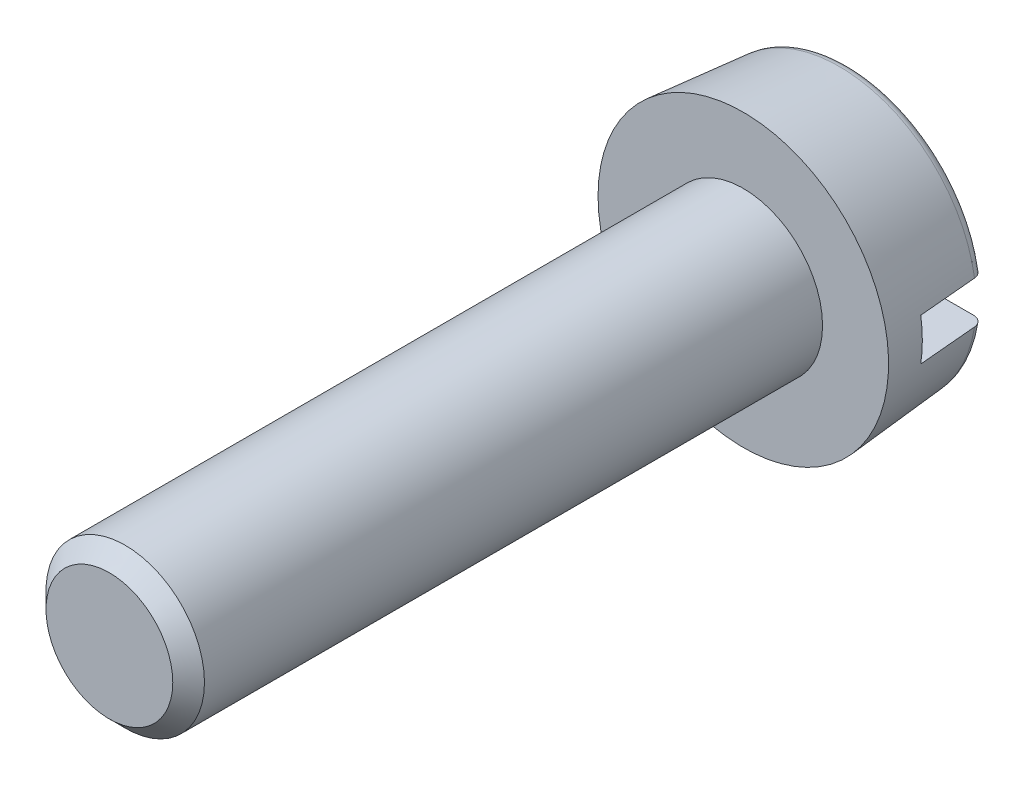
from build123d import *

# Parameters (mm, degrees)
ESQUISSE3_W             = 1.5
ESQUISSE3_H             = 12
ESQUISSE2_W             = 5.5
ESQUISSE2_H             = 0.8
ENLEV_MAT_EXTRU_1_DEPTH = 1.3
CHANFREIN1_SIZE         = 0.3


with BuildPart() as part:
    # Esquisse3 → Boss.-R_vol.1 (revolve)
    with BuildSketch(Plane(origin=(0, 0, 0), x_dir=(1, 0, 0), z_dir=(0, 1, 0))):
        with Locations((0.75, -6)):
            Rectangle(ESQUISSE3_W, ESQUISSE3_H)
    revolve(axis=Axis((0, 0, 0), (0, 0, 1)))

    # Esquisse1 → Base-R_volution (revolve)
    with BuildSketch(Plane(origin=(0, 0, 0), x_dir=(1, 0, 0), z_dir=(0, 1, 0))):
        with BuildLine():
            Line((0, 0), (2.75, 0))
            Line((2.75, 0), (2.590995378, 1.817431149))
            ThreePointArc((2.590995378, 1.817431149), (2.52687448, 1.947455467), (2.391756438, 2))
            Line((2.391756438, 2), (0, 2))
            Line((0, 2), (0, 0))
        make_face()
    revolve(axis=Axis((0, 0, 0), (0, 0, -1)))

    # Esquisse2 → Enlev. mat.-Extru.1 (cut)
    with BuildSketch(Plane.XY.offset(-2)):
        Rectangle(ESQUISSE2_W, ESQUISSE2_H)
    extrude(amount=ENLEV_MAT_EXTRU_1_DEPTH, mode=Mode.SUBTRACT)

    # Chanfrein1
    chanfrein1_edges = [part.edges().sort_by_distance(p)[0] for p in [
        (-1.5, 0, 12),
    ]]
    chamfer(chanfrein1_edges, length=CHANFREIN1_SIZE)


solid = part.part
